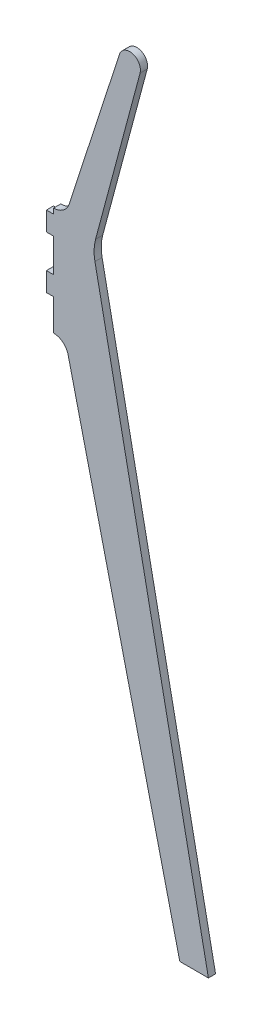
from build123d import *

# Parameters (mm, degrees)
SALIENTE_EXTRUIR1_DEPTH = 15


with BuildPart() as part:
    # Croquis1 → Saliente-Extruir1 (new body)
    with BuildSketch(Plane.XY):
        with BuildLine():
            Line((40.227366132, 63.947764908), (145.714078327, 388.60248242))
            ThreePointArc((145.714078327, 388.60248242), (173.5127211, 403.2280559), (188.860966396, 375.821791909))
            Line((188.860966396, 375.821791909), (95.514662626, 27.448643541))
            ThreePointArc((95.514662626, 27.448643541), (92.492880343, 6.997250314), (94.217514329, -13.604115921))
            Line((94.217514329, -13.604115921), (332.179186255, -1195.845070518))
            Line((332.179186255, -1195.845070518), (272.179186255, -1195.845070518))
            Line((272.179186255, -1195.845070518), (37.909982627, -210.994843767))
            ThreePointArc((37.909982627, -210.994843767), (26.877547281, -193.700932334), (7.5, -186.970058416))
            Line((7.5, -186.970058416), (7.5, -120.896697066))
            Line((7.5, -120.896697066), (-7.5, -120.896697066))
            Line((-7.5, -120.896697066), (-7.5, -80.896697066))
            Line((-7.5, -80.896697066), (7.5, -80.896697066))
            Line((7.5, -80.896697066), (7.5, -10.896697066))
            Line((7.5, -10.896697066), (-7.5, -10.896697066))
            Line((-7.5, -10.896697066), (-7.5, 29.103302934))
            Line((-7.5, 29.103302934), (7.5, 29.103302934))
            Line((7.5, 29.103302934), (7.5, 40.169941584))
            ThreePointArc((7.5, 40.169941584), (27.726624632, 46.741970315), (40.227366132, 63.947764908))
        make_face()
    extrude(amount=-SALIENTE_EXTRUIR1_DEPTH)


solid = part.part
